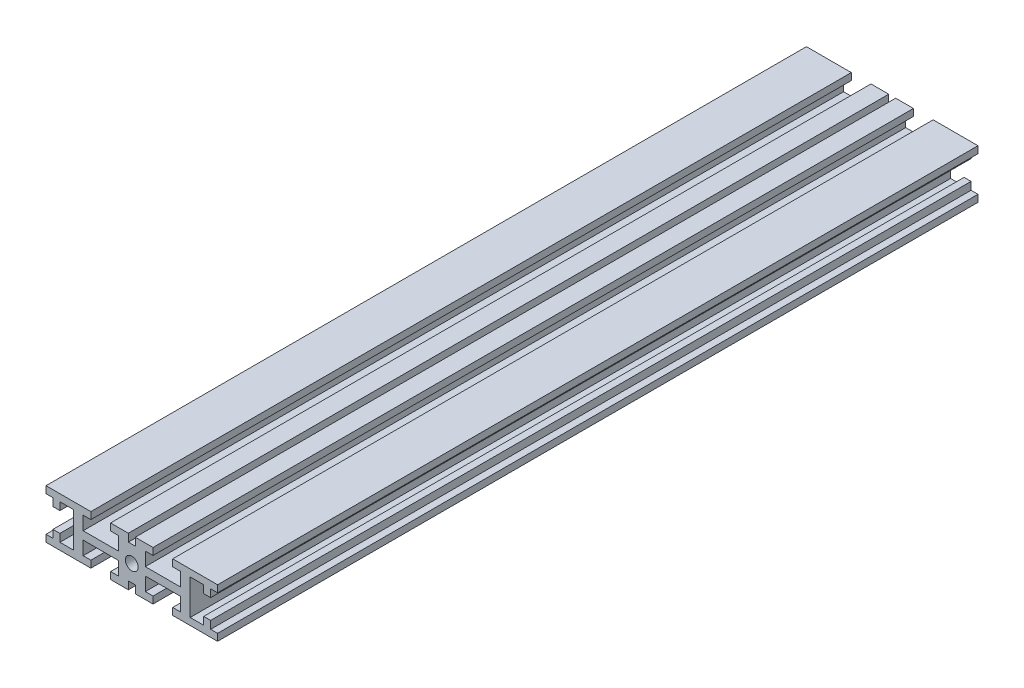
from build123d import *

# Parameters (mm, degrees)
BOSS_EXTRUDE1_DEPTH = 197
M4_TAPPED_HOLE1_D   = 3.3
SKETCH5_W           = 1.8
SKETCH5_H           = 2
CUT_EXTRUDE1_DEPTH  = 199.351388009


with BuildPart() as part:
    # Sketch1 → Boss-Extrude1 (new body)
    with BuildSketch(Plane.XY):
        Polygon((5.5, 6.35), (-5.5, 6.35), (-5.5, 4.55), (-3.5, 4.55), (-3.5, 1.05), (-12.6, 1.05), (-12.6, 4.55), (-10.6, 4.55), (-10.6, 6.35), (-22.225, 6.35), (-22.225, 4.55), (-20.425, 4.55), (-20.425, 2.55), (-18.625, 2.55), (-18.625, 4.55), (-15.125, 4.55), (-15.125, -4.55), (-18.625, -4.55), (-18.625, -2.55), (-20.425, -2.55), (-20.425, -4.55), (-22.225, -4.55), (-22.225, -6.35), (-10.6, -6.35), (-10.6, -4.55), (-12.6, -4.55), (-12.6, -1.05), (-3.5, -1.05), (-3.5, -4.55), (-5.5, -4.55), (-5.5, -6.35), (5.5, -6.35), (5.5, -4.55), (3.5, -4.55), (3.5, -1.05), (12.6, -1.05), (12.6, -4.55), (10.6, -4.55), (10.6, -6.35), (22.225, -6.35), (22.225, -4.55), (20.425, -4.55), (20.425, -2.55), (18.625, -2.55), (18.625, -4.55), (15.125, -4.55), (15.125, 4.55), (18.625, 4.55), (18.625, 2.55), (20.425, 2.55), (20.425, 4.55), (22.225, 4.55), (22.225, 6.35), (10.6, 6.35), (10.6, 4.55), (12.6, 4.55), (12.6, 1.05), (3.5, 1.05), (3.5, 4.55), (5.5, 4.55), align=None)
    extrude(amount=BOSS_EXTRUDE1_DEPTH)

    # M4 Tapped Hole1 (through all)
    with Locations(Plane.XY.offset(197)):
        with Locations((0, 0)):
            Hole(M4_TAPPED_HOLE1_D / 2)

    # Sketch5 → Cut-Extrude1 (cut, through all)
    with BuildSketch(Plane.XY.offset(197)):
        with Locations((0, -5.35)):
            Rectangle(SKETCH5_W, SKETCH5_H)
        with Locations((0, 5.35)):
            Rectangle(SKETCH5_W, SKETCH5_H)
    extrude(amount=-CUT_EXTRUDE1_DEPTH, mode=Mode.SUBTRACT)


solid = part.part
